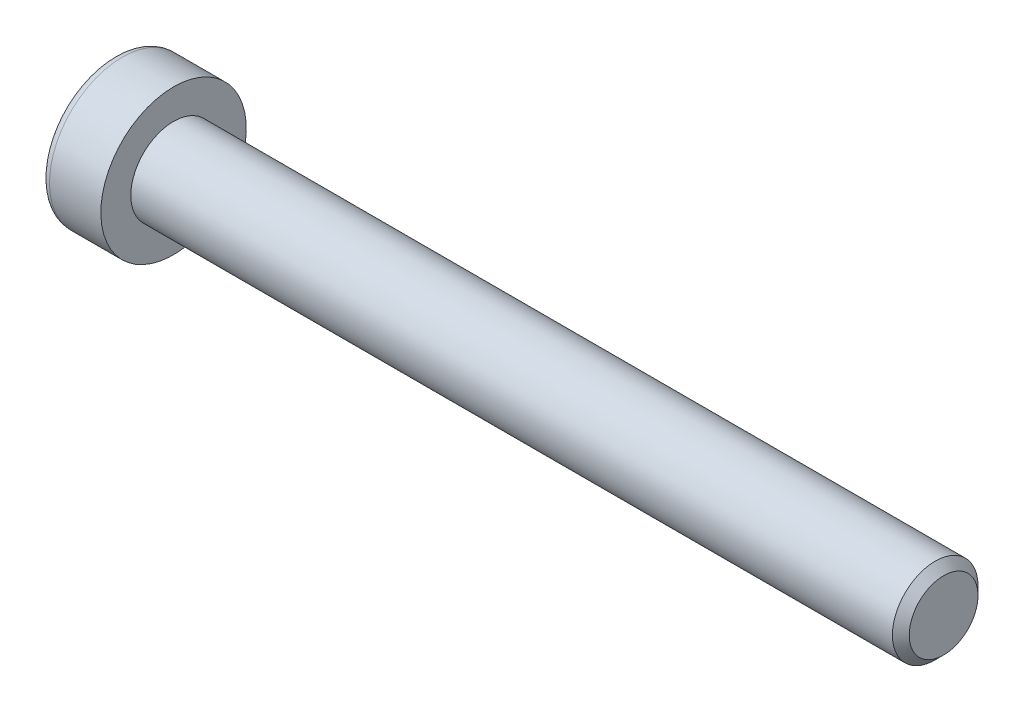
ISO-10303-21;
HEADER;
FILE_DESCRIPTION(('STEP AP214'),'2;1');
FILE_NAME('part.step','',(''),(''),'','','');
FILE_SCHEMA(('AUTOMOTIVE_DESIGN { 1 0 10303 214 1 1 1 1 }'));
ENDSEC;
DATA;
#1=APPLICATION_CONTEXT('core data for automotive mechanical design processes');
#2=APPLICATION_PROTOCOL_DEFINITION('international standard','automotive_design',2000,#1);
#3=PRODUCT_CONTEXT('',#1,'mechanical');
#4=PRODUCT('Part','Part','',(#3));
#5=PRODUCT_RELATED_PRODUCT_CATEGORY('part','',(#4));
#6=PRODUCT_DEFINITION_FORMATION('','',#4);
#7=PRODUCT_DEFINITION_CONTEXT('part definition',#1,'design');
#8=PRODUCT_DEFINITION('design','',#6,#7);
#9=PRODUCT_DEFINITION_SHAPE('','',#8);
#10=(LENGTH_UNIT() NAMED_UNIT(*) SI_UNIT(.MILLI.,.METRE.));
#11=(NAMED_UNIT(*) PLANE_ANGLE_UNIT() SI_UNIT($,.RADIAN.));
#12=(NAMED_UNIT(*) SI_UNIT($,.STERADIAN.) SOLID_ANGLE_UNIT());
#13=UNCERTAINTY_MEASURE_WITH_UNIT(LENGTH_MEASURE(1.E-05),#10,'distance_accuracy_value','');
#14=(GEOMETRIC_REPRESENTATION_CONTEXT(3) GLOBAL_UNCERTAINTY_ASSIGNED_CONTEXT((#13)) GLOBAL_UNIT_ASSIGNED_CONTEXT((#10,
#11,#12)) REPRESENTATION_CONTEXT('',''));
#15=CARTESIAN_POINT('',(0.,0.,0.));
#16=DIRECTION('',(0.,0.,1.));
#17=DIRECTION('',(1.,0.,0.));
#18=AXIS2_PLACEMENT_3D('',#15,#16,#17);
#19=CARTESIAN_POINT('',(-3.5,-1.5,0.866025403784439));
#20=DIRECTION('',(0.,-0.5,0.866025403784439));
#21=DIRECTION('',(0.,-0.866025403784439,-0.5));
#22=AXIS2_PLACEMENT_3D('',#19,#20,#21);
#23=PLANE('',#22);
#24=DIRECTION('',(1.,0.,0.));
#25=VECTOR('',#24,1.);
#26=CARTESIAN_POINT('',(-3.5,-1.5,0.866025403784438));
#27=LINE('',#26,#25);
#28=CARTESIAN_POINT('',(-0.799999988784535,-1.49999996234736,0.866025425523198));
#29=VERTEX_POINT('',#28);
#30=CARTESIAN_POINT('',(-3.5,-1.5,0.866025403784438));
#31=VERTEX_POINT('',#30);
#32=EDGE_CURVE('E78',#29,#31,#27,.F.);
#33=ORIENTED_EDGE('',*,*,#32,.T.);
#34=DIRECTION('',(0.,-0.866025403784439,-0.5));
#35=VECTOR('',#34,1.);
#36=CARTESIAN_POINT('',(-3.5,-1.5,0.866025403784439));
#37=LINE('',#36,#35);
#38=CARTESIAN_POINT('',(-3.5,0.,1.73205080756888));
#39=VERTEX_POINT('',#38);
#40=EDGE_CURVE('E90',#39,#31,#37,.T.);
#41=ORIENTED_EDGE('',*,*,#40,.F.);
#42=DIRECTION('',(1.,0.,0.));
#43=VECTOR('',#42,1.);
#44=CARTESIAN_POINT('',(-3.5,0.,1.73205080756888));
#45=LINE('',#44,#43);
#46=CARTESIAN_POINT('',(-0.799999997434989,1.17012725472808E-08,1.73205080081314));
#47=VERTEX_POINT('',#46);
#48=EDGE_CURVE('E73',#39,#47,#45,.T.);
#49=ORIENTED_EDGE('',*,*,#48,.T.);
#50=CARTESIAN_POINT('',(-0.800000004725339,-1.6941548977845E-08,1.73205077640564));
#51=CARTESIAN_POINT('',(-0.778021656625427,-0.0659159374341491,1.69399421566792));
#52=CARTESIAN_POINT('',(-0.758033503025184,-0.132400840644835,1.65560914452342));
#53=CARTESIAN_POINT('',(-0.723144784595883,-0.266521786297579,1.57817438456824));
#54=CARTESIAN_POINT('',(-0.708256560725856,-0.334160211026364,1.53912332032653));
#55=CARTESIAN_POINT('',(-0.685081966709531,-0.468598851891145,1.46150513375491));
#56=CARTESIAN_POINT('',(-0.676641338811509,-0.535378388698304,1.42294995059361));
#57=CARTESIAN_POINT('',(-0.666566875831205,-0.669251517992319,1.34565826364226));
#58=CARTESIAN_POINT('',(-0.664924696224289,-0.736344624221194,1.306922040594));
#59=CARTESIAN_POINT('',(-0.668349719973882,-0.861700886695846,1.23454756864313));
#60=CARTESIAN_POINT('',(-0.672575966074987,-0.919982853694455,1.2008984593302));
#61=CARTESIAN_POINT('',(-0.685967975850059,-1.03616709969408,1.13381945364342));
#62=CARTESIAN_POINT('',(-0.695138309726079,-1.09406897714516,1.10038978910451));
#63=CARTESIAN_POINT('',(-0.718062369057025,-1.21049257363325,1.03317259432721));
#64=CARTESIAN_POINT('',(-0.731913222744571,-1.26899956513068,0.999393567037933));
#65=CARTESIAN_POINT('',(-0.763348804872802,-1.38514116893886,0.93233918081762));
#66=CARTESIAN_POINT('',(-0.780926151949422,-1.44277726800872,0.899062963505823));
#67=CARTESIAN_POINT('',(-0.799999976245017,-1.49999992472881,0.866025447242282));
#68=B_SPLINE_CURVE_WITH_KNOTS('',3,(#50,#51,#52,#53,#54,#55,#56,#57,#58,#59,#60,#61,#62,#63,#64,
#65,#66,#67),.UNSPECIFIED.,.F.,.F.,(4,2,2,2,2,2,2,2,4),(0.,0.237762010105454,0.476095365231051,
0.708530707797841,0.940680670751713,1.14278081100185,1.34506808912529,1.55184112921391,
1.75820836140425),.UNSPECIFIED.);
#69=EDGE_CURVE('E19',#47,#29,#68,.T.);
#70=ORIENTED_EDGE('',*,*,#69,.T.);
#71=EDGE_LOOP('',(#33,#41,#49,#70));
#72=FACE_BOUND('',#71,.T.);
#73=ADVANCED_FACE('F15',(#72),#23,.F.);
#74=CARTESIAN_POINT('',(-3.5,-1.5,-0.866025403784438));
#75=DIRECTION('',(0.,-1.,0.));
#76=DIRECTION('',(0.,0.,-1.));
#77=AXIS2_PLACEMENT_3D('',#74,#75,#76);
#78=PLANE('',#77);
#79=DIRECTION('',(1.,0.,0.));
#80=VECTOR('',#79,1.);
#81=CARTESIAN_POINT('',(-3.5,-1.5,-0.866025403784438));
#82=LINE('',#81,#80);
#83=CARTESIAN_POINT('',(-0.799999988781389,-1.5,-0.86602536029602));
#84=VERTEX_POINT('',#83);
#85=CARTESIAN_POINT('',(-3.5,-1.5,-0.866025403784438));
#86=VERTEX_POINT('',#85);
#87=EDGE_CURVE('E217',#84,#86,#82,.F.);
#88=ORIENTED_EDGE('',*,*,#87,.T.);
#89=DIRECTION('',(0.,0.,-1.));
#90=VECTOR('',#89,1.);
#91=CARTESIAN_POINT('',(-3.5,-1.5,-0.866025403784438));
#92=LINE('',#91,#90);
#93=EDGE_CURVE('E89',#31,#86,#92,.T.);
#94=ORIENTED_EDGE('',*,*,#93,.F.);
#95=ORIENTED_EDGE('',*,*,#32,.F.);
#96=CARTESIAN_POINT('',(-0.800000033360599,-1.49999996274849,0.866025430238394));
#97=CARTESIAN_POINT('',(-0.778021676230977,-1.49999998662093,0.789912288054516));
#98=CARTESIAN_POINT('',(-0.758033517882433,-1.49999999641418,0.713142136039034));
#99=CARTESIAN_POINT('',(-0.723144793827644,-1.50000000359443,0.55827260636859));
#100=CARTESIAN_POINT('',(-0.708256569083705,-1.50000000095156,0.480170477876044));
#101=CARTESIAN_POINT('',(-0.685081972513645,-1.49999999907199,0.324934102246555));
#102=CARTESIAN_POINT('',(-0.676641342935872,-1.49999999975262,0.24782373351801));
#103=CARTESIAN_POINT('',(-0.666566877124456,-1.50000000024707,0.0932403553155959));
#104=CARTESIAN_POINT('',(-0.664924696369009,-1.50000000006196,0.0157679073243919));
#105=CARTESIAN_POINT('',(-0.668349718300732,-1.49999999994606,-0.128981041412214));
#106=CARTESIAN_POINT('',(-0.672575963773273,-1.49999999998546,-0.196279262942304));
#107=CARTESIAN_POINT('',(-0.685967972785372,-1.50000000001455,-0.330437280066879));
#108=CARTESIAN_POINT('',(-0.695138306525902,-1.5000000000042,-0.397296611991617));
#109=CARTESIAN_POINT('',(-0.718062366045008,-1.49999999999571,-0.531731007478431));
#110=CARTESIAN_POINT('',(-0.731913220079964,-1.49999999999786,-0.599289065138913));
#111=CARTESIAN_POINT('',(-0.763348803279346,-1.50000000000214,-0.73339784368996));
#112=CARTESIAN_POINT('',(-0.780926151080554,-1.50000000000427,-0.799950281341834));
#113=CARTESIAN_POINT('',(-0.79999997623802,-1.5,-0.866025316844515));
#114=B_SPLINE_CURVE_WITH_KNOTS('',3,(#96,#97,#98,#99,#100,#101,#102,#103,#104,#105,#106,#107,
#108,#109,#110,#111,#112,#113),.UNSPECIFIED.,.F.,.F.,(4,2,2,2,2,2,2,2,4),(0.,0.237762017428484,
0.476095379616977,0.708530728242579,0.940680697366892,1.14278084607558,1.34506813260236,
1.55184118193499,1.75820842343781),.UNSPECIFIED.);
#115=EDGE_CURVE('E83',#29,#84,#114,.T.);
#116=ORIENTED_EDGE('',*,*,#115,.T.);
#117=EDGE_LOOP('',(#88,#94,#95,#116));
#118=FACE_BOUND('',#117,.T.);
#119=ADVANCED_FACE('F87',(#118),#78,.F.);
#120=CARTESIAN_POINT('',(-3.5,0.,1.73205080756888));
#121=DIRECTION('',(0.,0.500000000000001,0.866025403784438));
#122=DIRECTION('',(0.,-0.866025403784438,0.500000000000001));
#123=AXIS2_PLACEMENT_3D('',#120,#121,#122);
#124=PLANE('',#123);
#125=ORIENTED_EDGE('',*,*,#48,.F.);
#126=DIRECTION('',(0.,-0.866025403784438,0.500000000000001));
#127=VECTOR('',#126,1.);
#128=CARTESIAN_POINT('',(-3.5,0.,1.73205080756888));
#129=LINE('',#128,#127);
#130=CARTESIAN_POINT('',(-3.5,1.5,0.866025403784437));
#131=VERTEX_POINT('',#130);
#132=EDGE_CURVE('E220',#131,#39,#129,.T.);
#133=ORIENTED_EDGE('',*,*,#132,.F.);
#134=DIRECTION('',(1.,0.,0.));
#135=VECTOR('',#134,1.);
#136=CARTESIAN_POINT('',(-3.5,1.5,0.866025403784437));
#137=LINE('',#136,#135);
#138=CARTESIAN_POINT('',(-0.799999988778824,1.5,0.866025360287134));
#139=VERTEX_POINT('',#138);
#140=EDGE_CURVE('E84',#131,#139,#137,.T.);
#141=ORIENTED_EDGE('',*,*,#140,.T.);
#142=CARTESIAN_POINT('',(-0.800000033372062,1.50000000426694,0.866025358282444));
#143=CARTESIAN_POINT('',(-0.778021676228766,1.4340841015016,0.904081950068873));
#144=CARTESIAN_POINT('',(-0.758033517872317,1.36759920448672,0.942467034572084));
#145=CARTESIAN_POINT('',(-0.723144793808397,1.23347826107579,1.01990180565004));
#146=CARTESIAN_POINT('',(-0.708256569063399,1.16583983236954,1.05895286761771));
#147=CARTESIAN_POINT('',(-0.68508197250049,1.03140118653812,1.13657105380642));
#148=CARTESIAN_POINT('',(-0.67664134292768,0.964621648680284,1.17512623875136));
#149=CARTESIAN_POINT('',(-0.666566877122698,0.83074851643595,1.25241792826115));
#150=CARTESIAN_POINT('',(-0.664924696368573,0.763655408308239,1.29115415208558));
#151=CARTESIAN_POINT('',(-0.668349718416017,0.638299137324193,1.36352862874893));
#152=CARTESIAN_POINT('',(-0.672575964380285,0.580017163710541,1.39717774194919));
#153=CARTESIAN_POINT('',(-0.68596797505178,0.46383290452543,1.46425675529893));
#154=CARTESIAN_POINT('',(-0.695138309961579,0.405931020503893,1.49768642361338));
#155=CARTESIAN_POINT('',(-0.718062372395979,0.28950741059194,1.56490362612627));
#156=CARTESIAN_POINT('',(-0.731913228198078,0.231000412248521,1.5986826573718));
#157=CARTESIAN_POINT('',(-0.763348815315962,0.114858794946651,1.6657370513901));
#158=CARTESIAN_POINT('',(-0.780926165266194,0.0572226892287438,1.69901327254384));
#159=CARTESIAN_POINT('',(-0.799999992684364,2.59531461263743E-08,1.73205079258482));
#160=B_SPLINE_CURVE_WITH_KNOTS('',3,(#142,#143,#144,#145,#146,#147,#148,#149,#150,#151,#152,
#153,#154,#155,#156,#157,#158,#159),.UNSPECIFIED.,.F.,.F.,(4,2,2,2,2,2,2,2,4),(0.,
0.23776201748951,0.476095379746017,0.708530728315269,0.940680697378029,1.14278086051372,
1.34506816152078,1.55184122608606,1.75820848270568),.UNSPECIFIED.);
#161=EDGE_CURVE('E120',#139,#47,#160,.T.);
#162=ORIENTED_EDGE('',*,*,#161,.T.);
#163=EDGE_LOOP('',(#125,#133,#141,#162));
#164=FACE_BOUND('',#163,.T.);
#165=ADVANCED_FACE('F113',(#164),#124,.F.);
#166=CARTESIAN_POINT('',(-3.5,0.,-1.73205080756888));
#167=DIRECTION('',(0.,-0.5,-0.866025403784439));
#168=DIRECTION('',(0.,0.866025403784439,-0.5));
#169=AXIS2_PLACEMENT_3D('',#166,#167,#168);
#170=PLANE('',#169);
#171=DIRECTION('',(1.,0.,0.));
#172=VECTOR('',#171,1.);
#173=CARTESIAN_POINT('',(-3.5,0.,-1.73205080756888));
#174=LINE('',#173,#172);
#175=CARTESIAN_POINT('',(-0.799999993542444,-5.19366415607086E-08,-1.73205079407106));
#176=VERTEX_POINT('',#175);
#177=CARTESIAN_POINT('',(-3.5,0.,-1.73205080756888));
#178=VERTEX_POINT('',#177);
#179=EDGE_CURVE('E125',#176,#178,#174,.F.);
#180=ORIENTED_EDGE('',*,*,#179,.T.);
#181=DIRECTION('',(0.,0.866025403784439,-0.5));
#182=VECTOR('',#181,1.);
#183=CARTESIAN_POINT('',(-3.5,0.,-1.73205080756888));
#184=LINE('',#183,#182);
#185=EDGE_CURVE('E38',#86,#178,#184,.T.);
#186=ORIENTED_EDGE('',*,*,#185,.F.);
#187=ORIENTED_EDGE('',*,*,#87,.F.);
#188=CARTESIAN_POINT('',(-0.800000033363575,-1.50000000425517,-0.86602535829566));
#189=CARTESIAN_POINT('',(-0.778021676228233,-1.43408410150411,-0.904081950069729));
#190=CARTESIAN_POINT('',(-0.758033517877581,-1.36759920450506,-0.942467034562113));
#191=CARTESIAN_POINT('',(-0.723144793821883,-1.23347826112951,-1.01990180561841));
#192=CARTESIAN_POINT('',(-0.708256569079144,-1.16583983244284,-1.05895286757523));
#193=CARTESIAN_POINT('',(-0.685081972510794,-1.03140118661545,-1.13657105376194));
#194=CARTESIAN_POINT('',(-0.676641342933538,-0.964621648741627,-1.17512623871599));
#195=CARTESIAN_POINT('',(-0.666566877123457,-0.830748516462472,-1.2524179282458));
#196=CARTESIAN_POINT('',(-0.664924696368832,-0.76365540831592,-1.29115415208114));
#197=CARTESIAN_POINT('',(-0.668349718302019,-0.638299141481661,-1.36352862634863));
#198=CARTESIAN_POINT('',(-0.672575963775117,-0.580017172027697,-1.39717773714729));
#199=CARTESIAN_POINT('',(-0.685967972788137,-0.463832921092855,-1.46425674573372));
#200=CARTESIAN_POINT('',(-0.695138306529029,-0.405931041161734,-1.49768641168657));
#201=CARTESIAN_POINT('',(-0.718062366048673,-0.289507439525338,-1.56490360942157));
#202=CARTESIAN_POINT('',(-0.731913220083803,-0.231000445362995,-1.59868263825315));
#203=CARTESIAN_POINT('',(-0.763348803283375,-0.114858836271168,-1.66573702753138));
#204=CARTESIAN_POINT('',(-0.7809261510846,-0.0572227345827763,-1.69901324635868));
#205=CARTESIAN_POINT('',(-0.799999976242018,-7.52801882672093E-08,-1.73205076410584));
#206=B_SPLINE_CURVE_WITH_KNOTS('',3,(#188,#189,#190,#191,#192,#193,#194,#195,#196,#197,#198,
#199,#200,#201,#202,#203,#204,#205),.UNSPECIFIED.,.F.,.F.,(4,2,2,2,2,2,2,2,4),(0.,
0.237762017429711,0.476095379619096,0.70853072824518,0.940680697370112,1.14278084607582,
1.34506813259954,1.55184118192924,1.75820842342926),.UNSPECIFIED.);
#207=EDGE_CURVE('E96',#84,#176,#206,.T.);
#208=ORIENTED_EDGE('',*,*,#207,.T.);
#209=EDGE_LOOP('',(#180,#186,#187,#208));
#210=FACE_BOUND('',#209,.T.);
#211=ADVANCED_FACE('F116',(#210),#170,.F.);
#212=CARTESIAN_POINT('',(-3.5,1.5,0.866025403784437));
#213=DIRECTION('',(0.,1.,0.));
#214=DIRECTION('',(0.,0.,1.));
#215=AXIS2_PLACEMENT_3D('',#212,#213,#214);
#216=PLANE('',#215);
#217=ORIENTED_EDGE('',*,*,#140,.F.);
#218=DIRECTION('',(0.,0.,1.));
#219=VECTOR('',#218,1.);
#220=CARTESIAN_POINT('',(-3.5,1.5,0.866025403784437));
#221=LINE('',#220,#219);
#222=CARTESIAN_POINT('',(-3.5,1.5,-0.866025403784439));
#223=VERTEX_POINT('',#222);
#224=EDGE_CURVE('E213',#223,#131,#221,.T.);
#225=ORIENTED_EDGE('',*,*,#224,.F.);
#226=DIRECTION('',(1.,0.,0.));
#227=VECTOR('',#226,1.);
#228=CARTESIAN_POINT('',(-3.5,1.5,-0.866025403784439));
#229=LINE('',#228,#227);
#230=CARTESIAN_POINT('',(-0.800000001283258,1.5,-0.866025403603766));
#231=VERTEX_POINT('',#230);
#232=EDGE_CURVE('E204',#223,#231,#229,.T.);
#233=ORIENTED_EDGE('',*,*,#232,.T.);
#234=CARTESIAN_POINT('',(-0.800000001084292,1.50000000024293,-0.866025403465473));
#235=CARTESIAN_POINT('',(-0.778021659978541,1.50000000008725,-0.789912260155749));
#236=CARTESIAN_POINT('',(-0.758033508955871,1.50000000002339,-0.713142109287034));
#237=CARTESIAN_POINT('',(-0.723144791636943,1.49999999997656,-0.558272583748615));
#238=CARTESIAN_POINT('',(-0.708256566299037,1.4999999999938,-0.480170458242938));
#239=CARTESIAN_POINT('',(-0.685081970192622,1.50000000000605,-0.324934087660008));
#240=CARTESIAN_POINT('',(-0.676641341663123,1.50000000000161,-0.247823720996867));
#241=CARTESIAN_POINT('',(-0.666566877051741,1.49999999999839,-0.0932403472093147));
#242=CARTESIAN_POINT('',(-0.664924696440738,1.4999999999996,-0.0157679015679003));
#243=CARTESIAN_POINT('',(-0.668349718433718,1.50000000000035,0.128981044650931));
#244=CARTESIAN_POINT('',(-0.672575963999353,1.5000000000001,0.196279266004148));
#245=CARTESIAN_POINT('',(-0.685967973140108,1.49999999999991,0.330437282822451));
#246=CARTESIAN_POINT('',(-0.695138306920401,1.49999999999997,0.397296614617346));
#247=CARTESIAN_POINT('',(-0.718062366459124,1.50000000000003,0.531731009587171));
#248=CARTESIAN_POINT('',(-0.731913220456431,1.50000000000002,0.599289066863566));
#249=CARTESIAN_POINT('',(-0.76334880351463,1.49999999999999,0.733397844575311));
#250=CARTESIAN_POINT('',(-0.780926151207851,1.49999999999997,0.799950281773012));
#251=CARTESIAN_POINT('',(-0.799999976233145,1.5,0.866025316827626));
#252=B_SPLINE_CURVE_WITH_KNOTS('',3,(#234,#235,#236,#237,#238,#239,#240,#241,#242,#243,#244,
#245,#246,#247,#248,#249,#250,#251),.UNSPECIFIED.,.F.,.F.,(4,2,2,2,2,2,2,2,4),(0.,
0.237762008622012,0.47609536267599,0.708530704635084,0.940680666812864,1.14278081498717,
1.34506810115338,1.55184114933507,1.7582083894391),.UNSPECIFIED.);
#253=EDGE_CURVE('E97',#231,#139,#252,.T.);
#254=ORIENTED_EDGE('',*,*,#253,.T.);
#255=EDGE_LOOP('',(#217,#225,#233,#254));
#256=FACE_BOUND('',#255,.T.);
#257=ADVANCED_FACE('F135',(#256),#216,.F.);
#258=CARTESIAN_POINT('',(-0.806000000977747,0.,0.));
#259=DIRECTION('',(-1.,0.,0.));
#260=DIRECTION('',(0.,0.,1.));
#261=AXIS2_PLACEMENT_3D('',#258,#259,#260);
#262=CONICAL_SURFACE('',#261,1.74244311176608,1.04719755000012);
#263=CARTESIAN_POINT('',(0.200000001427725,0.,0.));
#264=VERTEX_POINT('',#263);
#265=VERTEX_LOOP('',#264);
#266=FACE_BOUND('',#265,.T.);
#267=ORIENTED_EDGE('',*,*,#253,.F.);
#268=CARTESIAN_POINT('',(-0.80000000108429,1.49999999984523,-0.866025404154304));
#269=CARTESIAN_POINT('',(-0.778021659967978,1.4340840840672,-0.904081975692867));
#270=CARTESIAN_POINT('',(-0.758033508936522,1.36759918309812,-0.942467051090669));
#271=CARTESIAN_POINT('',(-0.723144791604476,1.23347823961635,-1.01990181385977));
#272=CARTESIAN_POINT('',(-0.708256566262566,1.16583981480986,-1.05895287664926));
#273=CARTESIAN_POINT('',(-0.685081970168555,1.03140117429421,-1.13657106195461));
#274=CARTESIAN_POINT('',(-0.676641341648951,0.964621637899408,-1.17512624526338));
#275=CARTESIAN_POINT('',(-0.666566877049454,0.830748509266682,-1.25241793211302));
#276=CARTESIAN_POINT('',(-0.664924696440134,0.763655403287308,-1.29115415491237));
#277=CARTESIAN_POINT('',(-0.668349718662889,0.63829913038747,-1.36352863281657));
#278=CARTESIAN_POINT('',(-0.672575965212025,0.580017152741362,-1.39717774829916));
#279=CARTESIAN_POINT('',(-0.685967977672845,0.463832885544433,-1.46425676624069));
#280=CARTESIAN_POINT('',(-0.695138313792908,0.405930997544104,-1.49768643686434));
#281=CARTESIAN_POINT('',(-0.71806237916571,0.289507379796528,-1.564903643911));
#282=CARTESIAN_POINT('',(-0.731913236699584,0.231000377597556,-1.59868267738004));
#283=CARTESIAN_POINT('',(-0.763348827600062,0.114858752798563,-1.66573707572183));
#284=CARTESIAN_POINT('',(-0.780926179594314,0.0572226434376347,-1.69901329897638));
#285=CARTESIAN_POINT('',(-0.800000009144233,-2.34264601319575E-08,-1.73205082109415));
#286=B_SPLINE_CURVE_WITH_KNOTS('',3,(#268,#269,#270,#271,#272,#273,#274,#275,#276,#277,#278,
#279,#280,#281,#282,#283,#284,#285),.UNSPECIFIED.,.F.,.F.,(4,2,2,2,2,2,2,2,4),(0.,
0.237762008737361,0.4760953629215,0.708530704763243,0.940680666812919,1.14278084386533,
1.34506815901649,1.55184123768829,1.75820850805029),.UNSPECIFIED.);
#287=EDGE_CURVE('E126',#231,#176,#286,.T.);
#288=ORIENTED_EDGE('',*,*,#287,.T.);
#289=ORIENTED_EDGE('',*,*,#207,.F.);
#290=ORIENTED_EDGE('',*,*,#115,.F.);
#291=ORIENTED_EDGE('',*,*,#69,.F.);
#292=ORIENTED_EDGE('',*,*,#161,.F.);
#293=EDGE_LOOP('',(#267,#288,#289,#290,#291,#292));
#294=FACE_BOUND('',#293,.T.);
#295=ADVANCED_FACE('F94',(#266,#294),#262,.F.);
#296=CARTESIAN_POINT('',(-3.5,1.5,-0.866025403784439));
#297=DIRECTION('',(0.,0.5,-0.866025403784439));
#298=DIRECTION('',(0.,0.866025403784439,0.5));
#299=AXIS2_PLACEMENT_3D('',#296,#297,#298);
#300=PLANE('',#299);
#301=ORIENTED_EDGE('',*,*,#232,.F.);
#302=DIRECTION('',(0.,0.866025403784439,0.5));
#303=VECTOR('',#302,1.);
#304=CARTESIAN_POINT('',(-3.5,0.,-1.73205080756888));
#305=LINE('',#304,#303);
#306=EDGE_CURVE('E215',#178,#223,#305,.T.);
#307=ORIENTED_EDGE('',*,*,#306,.F.);
#308=ORIENTED_EDGE('',*,*,#179,.F.);
#309=ORIENTED_EDGE('',*,*,#287,.F.);
#310=EDGE_LOOP('',(#301,#307,#308,#309));
#311=FACE_BOUND('',#310,.T.);
#312=ADVANCED_FACE('F144',(#311),#300,.F.);
#313=CARTESIAN_POINT('',(-3.5,2.99102540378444,0.));
#314=DIRECTION('',(-1.,0.,0.));
#315=DIRECTION('',(0.,0.,1.));
#316=AXIS2_PLACEMENT_3D('',#313,#314,#315);
#317=PLANE('',#316);
#318=ORIENTED_EDGE('',*,*,#185,.T.);
#319=ORIENTED_EDGE('',*,*,#306,.T.);
#320=ORIENTED_EDGE('',*,*,#224,.T.);
#321=ORIENTED_EDGE('',*,*,#132,.T.);
#322=ORIENTED_EDGE('',*,*,#40,.T.);
#323=ORIENTED_EDGE('',*,*,#93,.T.);
#324=EDGE_LOOP('',(#318,#319,#320,#321,#322,#323));
#325=FACE_BOUND('',#324,.T.);
#326=CARTESIAN_POINT('',(-3.5,0.,0.));
#327=DIRECTION('',(1.,0.,0.));
#328=DIRECTION('',(0.,1.,0.));
#329=AXIS2_PLACEMENT_3D('',#326,#327,#328);
#330=CIRCLE('',#329,3.75);
#331=CARTESIAN_POINT('',(-3.5,3.75,0.));
#332=VERTEX_POINT('',#331);
#333=EDGE_CURVE('E191',#332,#332,#330,.T.);
#334=ORIENTED_EDGE('',*,*,#333,.F.);
#335=EDGE_LOOP('',(#334));
#336=FACE_BOUND('',#335,.T.);
#337=ADVANCED_FACE('F178',(#325,#336),#317,.T.);
#338=CARTESIAN_POINT('',(-3.,0.,0.));
#339=DIRECTION('',(1.,0.,0.));
#340=DIRECTION('',(0.,0.,-1.));
#341=AXIS2_PLACEMENT_3D('',#338,#339,#340);
#342=TOROIDAL_SURFACE('',#341,3.75,0.5);
#343=CARTESIAN_POINT('',(-3.,0.,0.));
#344=DIRECTION('',(1.,0.,0.));
#345=DIRECTION('',(0.,1.,0.));
#346=AXIS2_PLACEMENT_3D('',#343,#344,#345);
#347=CIRCLE('',#346,4.25);
#348=CARTESIAN_POINT('',(-3.,4.25,0.));
#349=VERTEX_POINT('',#348);
#350=EDGE_CURVE('E231',#349,#349,#347,.T.);
#351=ORIENTED_EDGE('',*,*,#350,.F.);
#352=EDGE_LOOP('',(#351));
#353=FACE_BOUND('',#352,.T.);
#354=ORIENTED_EDGE('',*,*,#333,.T.);
#355=EDGE_LOOP('',(#354));
#356=FACE_BOUND('',#355,.T.);
#357=ADVANCED_FACE('F172',(#353,#356),#342,.T.);
#358=CARTESIAN_POINT('',(-1.75,0.,0.));
#359=DIRECTION('',(1.,0.,0.));
#360=DIRECTION('',(0.,1.,0.));
#361=AXIS2_PLACEMENT_3D('',#358,#359,#360);
#362=CYLINDRICAL_SURFACE('',#361,4.25);
#363=ORIENTED_EDGE('',*,*,#350,.T.);
#364=EDGE_LOOP('',(#363));
#365=FACE_BOUND('',#364,.T.);
#366=CARTESIAN_POINT('',(0.,0.,0.));
#367=DIRECTION('',(1.,0.,0.));
#368=DIRECTION('',(0.,1.,0.));
#369=AXIS2_PLACEMENT_3D('',#366,#367,#368);
#370=CIRCLE('',#369,4.25);
#371=CARTESIAN_POINT('',(0.,4.25,0.));
#372=VERTEX_POINT('',#371);
#373=EDGE_CURVE('E229',#372,#372,#370,.T.);
#374=ORIENTED_EDGE('',*,*,#373,.F.);
#375=EDGE_LOOP('',(#374));
#376=FACE_BOUND('',#375,.T.);
#377=ADVANCED_FACE('F168',(#365,#376),#362,.T.);
#378=CARTESIAN_POINT('',(45.,1.25,0.));
#379=DIRECTION('',(1.,0.,0.));
#380=DIRECTION('',(0.,0.,-1.));
#381=AXIS2_PLACEMENT_3D('',#378,#379,#380);
#382=PLANE('',#381);
#383=CARTESIAN_POINT('',(45.0000000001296,0.,0.));
#384=DIRECTION('',(-1.,0.,0.));
#385=DIRECTION('',(0.,0.,1.));
#386=AXIS2_PLACEMENT_3D('',#383,#384,#385);
#387=CIRCLE('',#386,2.00924000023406);
#388=CARTESIAN_POINT('',(45.0000000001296,0.,2.00924000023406));
#389=VERTEX_POINT('',#388);
#390=EDGE_CURVE('E227',#389,#389,#387,.T.);
#391=ORIENTED_EDGE('',*,*,#390,.F.);
#392=EDGE_LOOP('',(#391));
#393=FACE_BOUND('',#392,.T.);
#394=ADVANCED_FACE('F164',(#393),#382,.T.);
#395=CARTESIAN_POINT('',(0.,3.375,0.));
#396=DIRECTION('',(1.,0.,0.));
#397=DIRECTION('',(0.,0.,-1.));
#398=AXIS2_PLACEMENT_3D('',#395,#396,#397);
#399=PLANE('',#398);
#400=CARTESIAN_POINT('',(0.,0.,0.));
#401=DIRECTION('',(1.,0.,0.));
#402=DIRECTION('',(0.,1.,0.));
#403=AXIS2_PLACEMENT_3D('',#400,#401,#402);
#404=CIRCLE('',#403,2.5);
#405=CARTESIAN_POINT('',(0.,2.5,0.));
#406=VERTEX_POINT('',#405);
#407=EDGE_CURVE('E29',#406,#406,#404,.T.);
#408=ORIENTED_EDGE('',*,*,#407,.F.);
#409=EDGE_LOOP('',(#408));
#410=FACE_BOUND('',#409,.T.);
#411=ORIENTED_EDGE('',*,*,#373,.T.);
#412=EDGE_LOOP('',(#411));
#413=FACE_BOUND('',#412,.T.);
#414=ADVANCED_FACE('F157',(#410,#413),#399,.T.);
#415=CARTESIAN_POINT('',(44.5092399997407,0.,0.));
#416=DIRECTION('',(-1.,0.,0.));
#417=DIRECTION('',(0.,0.,1.));
#418=AXIS2_PLACEMENT_3D('',#415,#416,#417);
#419=CONICAL_SURFACE('',#418,2.49999999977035,0.785398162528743);
#420=ORIENTED_EDGE('',*,*,#390,.T.);
#421=EDGE_LOOP('',(#420));
#422=FACE_BOUND('',#421,.T.);
#423=CARTESIAN_POINT('',(44.50924,0.,0.));
#424=DIRECTION('',(1.,0.,0.));
#425=DIRECTION('',(0.,1.,0.));
#426=AXIS2_PLACEMENT_3D('',#423,#424,#425);
#427=CIRCLE('',#426,2.5);
#428=CARTESIAN_POINT('',(44.50924,2.5,0.));
#429=VERTEX_POINT('',#428);
#430=EDGE_CURVE('E10',#429,#429,#427,.F.);
#431=ORIENTED_EDGE('',*,*,#430,.F.);
#432=EDGE_LOOP('',(#431));
#433=FACE_BOUND('',#432,.T.);
#434=ADVANCED_FACE('F150',(#422,#433),#419,.T.);
#435=CARTESIAN_POINT('',(37.,0.,0.));
#436=DIRECTION('',(1.,0.,0.));
#437=DIRECTION('',(0.,1.,0.));
#438=AXIS2_PLACEMENT_3D('',#435,#436,#437);
#439=CYLINDRICAL_SURFACE('',#438,2.5);
#440=ORIENTED_EDGE('',*,*,#430,.T.);
#441=EDGE_LOOP('',(#440));
#442=FACE_BOUND('',#441,.T.);
#443=ORIENTED_EDGE('',*,*,#407,.T.);
#444=EDGE_LOOP('',(#443));
#445=FACE_BOUND('',#444,.T.);
#446=ADVANCED_FACE('F148',(#442,#445),#439,.T.);
#447=CLOSED_SHELL('',(#73,#119,#165,#211,#257,#295,#312,#337,#357,#377,#394,#414,#434,#446));
#448=MANIFOLD_SOLID_BREP('B1',#447);
#449=ADVANCED_BREP_SHAPE_REPRESENTATION('',(#18,#448),#14);
#450=SHAPE_DEFINITION_REPRESENTATION(#9,#449);
ENDSEC;
END-ISO-10303-21;
